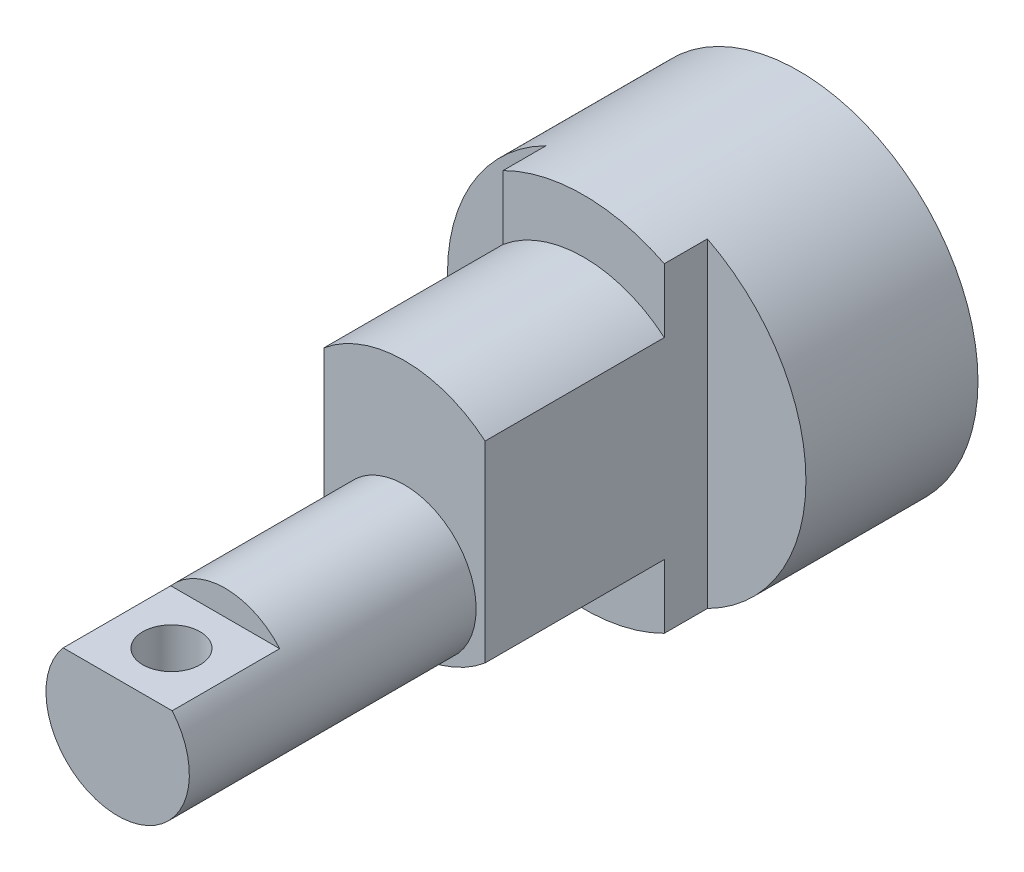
from build123d import *

# Parameters (mm, degrees)
SKETCH_1_R          = 50
EXTRUDE_1_DEPTH     = 60
SKETCH_2_R          = 35
EXTRUDE_2_DEPTH     = 50
SKETCH_3_R          = 20
EXTRUDE_3_DEPTH     = 80
SKETCH_4_W          = 40
SKETCH_4_H          = 30
CUT_EXTRUDE_1_DEPTH = 12
SKETCH_5_R          = 8
CUT_EXTRUDE_2_DEPTH = 204.233855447
CUT_EXTRUDE_3_DEPTH = 159.631648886


with BuildPart() as part:
    # Sketch 1 → Extrude 1 (new body)
    with BuildSketch(Plane.XY):
        Circle(SKETCH_1_R)
    extrude(amount=EXTRUDE_1_DEPTH)

    # Sketch 2 → Extrude 2 (add)
    with BuildSketch(Plane.XY.offset(60)):
        Circle(SKETCH_2_R)
    extrude(amount=EXTRUDE_2_DEPTH)

    # Sketch 3 → Extrude 3 (add)
    with BuildSketch(Plane.XY.offset(110)):
        with Locations(Location((0, -15, 0), (0, 0, 270))):
            Circle(SKETCH_3_R)
    extrude(amount=EXTRUDE_3_DEPTH)

    # Sketch 4 → Cut-Extrude 1 (cut)
    with BuildSketch(Plane(origin=(0, 10, 0), x_dir=(1, 0, 0), z_dir=(0, 1, 0))):
        with Locations((0, -175)):
            Rectangle(SKETCH_4_W, SKETCH_4_H)
    extrude(amount=-CUT_EXTRUDE_1_DEPTH, mode=Mode.SUBTRACT)

    # Sketch 5 → Cut-Extrude 2 (cut, through all)
    with BuildSketch(Plane(origin=(0, -2, 0), x_dir=(1, 0, 0), z_dir=(0, 1, 0))):
        with Locations(Location((0, -175, 0), (0, 0, 270))):
            Circle(SKETCH_5_R)
    extrude(amount=-CUT_EXTRUDE_2_DEPTH, mode=Mode.SUBTRACT)

    # Sketch 6 → Cut-Extrude 3 (cut, through all)
    with BuildSketch(Plane.XY.offset(48)):
        with BuildLine():
            Line((22.5, -44.651427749), (22.5, 44.651427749))
            ThreePointArc((22.5, 44.651427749), (50, 0), (22.5, -44.651427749))
        make_face()
        with BuildLine():
            Line((-22.5, 44.651427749), (-22.5, -44.651427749))
            ThreePointArc((-22.5, -44.651427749), (-50, 0), (-22.5, 44.651427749))
        make_face()
    extrude(amount=CUT_EXTRUDE_3_DEPTH, mode=Mode.SUBTRACT)


solid = part.part
